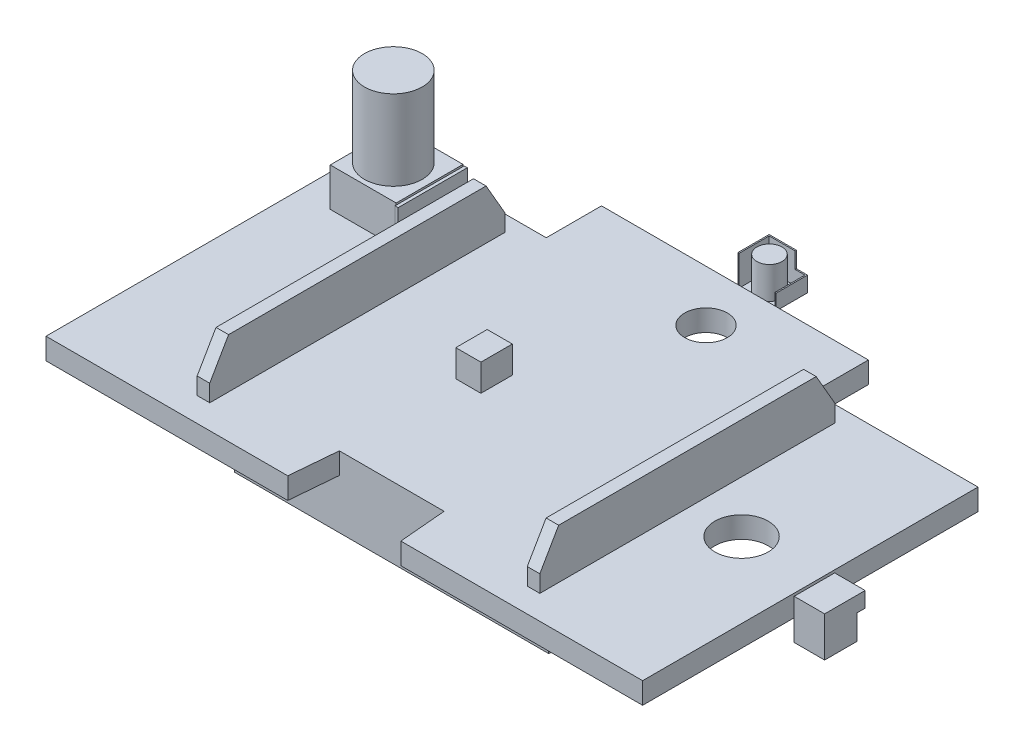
from build123d import *
from OCP.BRepFilletAPI import BRepFilletAPI_MakeChamfer

# Parameters (mm, degrees)
AUFSATZ_LINEAR_AUSTRAGEN1_DEPTH      = 34
SKIZZE3_W                            = 40
SKIZZE3_H                            = 45
AUFSATZ_LINEAR_AUSTRAGEN3_DEPTH      = 31
SKIZZE4_R                            = 42.5
SCHNITT_LINEAR_AUSTRAGEN1_DEPTH      = 597.552596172
AUFSATZ_LINEAR_AUSTRAGEN4_DEPTH      = 48.5
AUFSATZ_LINEAR_AUSTRAGEN4_DEPTH_BACK = 17.5
SKIZZE13_W                           = 69.5
SKIZZE13_H                           = 63.7
SCHNITT_LINEAR_AUSTRAGEN5_DEPTH      = 34
AUFSATZ_LINEAR_START                 = 6.7
SKIZZE18_W                           = 105
SKIZZE18_H                           = 106.5
AUFSATZ_LINEAR_AUSTRAGEN5_DEPTH      = 61.3
SKIZZE19_R                           = 46
AUFSATZ_LINEAR_AUSTRAGEN6_DEPTH      = 127.5
LINEAR_AUSTRAGEN_D_NN1_START         = -53.25
LINEAR_AUSTRAGEN_D_NN1_DEPTH         = 55
SCHNITT_LINEAR_AUSTRAGEN6_DEPTH      = 5.3
SKIZZE22_W                           = 48.5
SKIZZE22_H                           = 24.4
SCHNITT_LINEAR_AUSTRAGEN7_DEPTH      = 5
SKIZZE23_W                           = 40
SKIZZE23_H                           = 50
AUFSATZ_LINEAR_AUSTRAGEN7_DEPTH      = 43
SKIZZE24_R                           = 34
SCHNITT_LINEAR_AUSTRAGEN8_DEPTH      = 663.040406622
SKIZZE25_W                           = 61
SKIZZE25_H                           = 50
AUFSATZ_LINEAR_AUSTRAGEN8_DEPTH      = 50.01
SKIZZE27_W                           = 17.5
SKIZZE27_H                           = 25.5
SCHNITT_LINEAR_AUSTRAGEN10_DEPTH     = 50.01
SKIZZE26_W                           = 57
SKIZZE26_H                           = 48.01
SCHNITT_LINEAR_AUSTRAGEN9_DEPTH      = 48
SKIZZE28_R                           = 20.05
AUFSATZ_LINEAR_AUSTRAGEN9_DEPTH      = 51
SCHNITT_LINEAR_AUSTRAGEN11_DEPTH     = 34
SKIZZE30_W                           = 20
SKIZZE30_H                           = 470
AUFSATZ_LINEAR_AUSTRAGEN10_DEPTH     = 79
SKIZZE31_W                           = 500
SKIZZE31_H                           = 20
SKIZZE31_W_2                         = 580
AUFSATZ_LINEAR_AUSTRAGEN11_DEPTH     = 79
FASE1_SIZE                           = 30
FASE1_SIZE2                          = 51.961524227


with BuildPart() as part:
    # Skizze1 → Aufsatz-Linear austragen1 (new body)
    with BuildSketch(Plane(origin=(0, 0, 0), x_dir=(1, 0, 0), z_dir=(0, 1, 0))):
        Polygon((-212.5, 267), (-212.5, 355), (212.5, 355), (212.5, 267), (475, 267), (475, -267), (-475, -267), (-475, 267), align=None)
    extrude(amount=-AUFSATZ_LINEAR_AUSTRAGEN1_DEPTH)

    # Skizze3 → Aufsatz-Linear austragen3 (add)
    with BuildSketch(Plane.XZ.offset(34)):
        with Locations((0, 74.5)):
            Rectangle(SKIZZE3_W, SKIZZE3_H)
        with Locations((0, -95.5)):
            Rectangle(SKIZZE3_W, SKIZZE3_H)
    extrude(amount=AUFSATZ_LINEAR_AUSTRAGEN3_DEPTH)

    # Skizze4 → Schnitt-Linear austragen1 (cut, through all)
    with BuildSketch(Plane(origin=(0, 0, 0), x_dir=(1, 0, 0), z_dir=(0, 1, 0))):
        with Locations(Location((355, 10.5, 0), (0, 0, 270))):
            Circle(SKIZZE4_R)
    extrude(amount=-SCHNITT_LINEAR_AUSTRAGEN1_DEPTH, mode=Mode.SUBTRACT)

    # Skizze13 → Aufsatz-Linear austragen4 (add, two sides: drawn at the far end of the back side and taken through both)
    with BuildSketch(Plane(origin=(475, 0, 0), x_dir=(0, 0, -1), z_dir=(1, 0, 0)).offset(-AUFSATZ_LINEAR_AUSTRAGEN4_DEPTH_BACK)):
        with Locations((9.05, -36.15)):
            Rectangle(SKIZZE13_W, SKIZZE13_H)
    extrude(amount=AUFSATZ_LINEAR_AUSTRAGEN4_DEPTH + AUFSATZ_LINEAR_AUSTRAGEN4_DEPTH_BACK)

    # Skizze17 → Schnitt-Linear austragen5 (cut)
    with BuildSketch(Plane.XZ.offset(68)):
        with BuildLine():
            Line((523.5, -25.8), (515.060351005, -25.8))
            ThreePointArc((515.060351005, -25.8), (467.505550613, -31.296229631), (475, 15.984853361))
            Line((475, 15.984853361), (475, 25.7))
            Line((475, 25.7), (457.5, 25.7))
            Line((457.5, 25.7), (457.5, -43.8))
            Line((457.5, -43.8), (523.5, -43.8))
            Line((523.5, -43.8), (523.5, -25.8))
        make_face()
    extrude(amount=-SCHNITT_LINEAR_AUSTRAGEN5_DEPTH, mode=Mode.SUBTRACT)



with BuildPart() as body_2:
    # Skizze18 → Aufsatz-Linear austragen5 (new body)
    with BuildSketch(Plane(origin=(0, 0, 0), x_dir=(1, 0, 0), z_dir=(0, 1, 0)).offset(AUFSATZ_LINEAR_START)):
        with Locations((-364.4, 180.73)):
            Rectangle(SKIZZE18_W, SKIZZE18_H)
    extrude(amount=AUFSATZ_LINEAR_AUSTRAGEN5_DEPTH)

    # Skizze19 → Aufsatz-Linear austragen6 (add)
    with BuildSketch(Plane(origin=(0, 68, 0), x_dir=(1, 0, 0), z_dir=(0, 1, 0))):
        with Locations(Location((-369.7, 180.73, 0), (0, 0, 270))):
            Circle(SKIZZE19_R)
    extrude(amount=AUFSATZ_LINEAR_AUSTRAGEN6_DEPTH)


with BuildPart() as part_1:
    add(part.part)

    add(body_2.part)  # Linear-Austragen-D_nn1 merges body 2
    # Skizze20 → Linear-Austragen-D_nn1 (add, symmetric)
    with BuildSketch(Plane.XY.offset(-127.48).offset(LINEAR_AUSTRAGEN_D_NN1_START)):
        Polygon((-311.9, 65), (-311.9, 0), (-277.5, 0), (-277.5, 5), (-306.9, 5), (-306.9, 65), align=None)
    extrude(amount=LINEAR_AUSTRAGEN_D_NN1_DEPTH, both=True)

    # Skizze21 → Schnitt-Linear austragen6 (cut)
    with BuildSketch(Plane.XZ.offset(34)):
        with BuildLine():
            Line((475, -43.8), (523.5, -43.8))
            Line((523.5, -43.8), (523.5, -25.8))
            Line((523.5, -25.8), (515.060351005, -25.8))
            ThreePointArc((515.060351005, -25.8), (497.277916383, -39.443072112), (475, -36.984853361))
            Line((475, -36.984853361), (475, -43.8))
        make_face()
    extrude(amount=-SCHNITT_LINEAR_AUSTRAGEN6_DEPTH, mode=Mode.SUBTRACT)

    # Skizze22 → Schnitt-Linear austragen7 (cut)
    with BuildSketch(Plane(origin=(0, 0, -43.8), x_dir=(-1, 0, 0), z_dir=(0, 0, -1))):
        with Locations((-499.25, -16.5)):
            Rectangle(SKIZZE22_W, SKIZZE22_H)
    extrude(amount=-SCHNITT_LINEAR_AUSTRAGEN7_DEPTH, mode=Mode.SUBTRACT)

    # Skizze23 → Aufsatz-Linear austragen7 (add)
    with BuildSketch(Plane(origin=(0, 0, 0), x_dir=(-1, 0, 0), z_dir=(0, 1, 0))):
        with Locations((70, -25.5)):
            Rectangle(SKIZZE23_W, SKIZZE23_H)
    extrude(amount=AUFSATZ_LINEAR_AUSTRAGEN7_DEPTH)

    # Skizze24 → Schnitt-Linear austragen8 (cut, through all)
    with BuildSketch(Plane(origin=(0, 0, 0), x_dir=(1, 0, 0), z_dir=(0, 1, 0))):
        with Locations(Location((35.42, 273.5, 0), (0, 0, 270))):
            Circle(SKIZZE24_R)
    extrude(amount=-SCHNITT_LINEAR_AUSTRAGEN8_DEPTH, mode=Mode.SUBTRACT)

    # Skizze25 → Aufsatz-Linear austragen8 (add)
    with BuildSketch(Plane(origin=(0, 0, -355), x_dir=(-1, 0, 0), z_dir=(0, 0, -1))):
        with Locations((-34.96, 19)):
            Rectangle(SKIZZE25_W, SKIZZE25_H)
    extrude(amount=AUFSATZ_LINEAR_AUSTRAGEN8_DEPTH)

    # Skizze27 → Schnitt-Linear austragen10 (cut)
    with BuildSketch(Plane(origin=(0, 0, -405.01), x_dir=(-1, 0, 0), z_dir=(0, 0, -1))):
        with Locations((-56.71, 31.25)):
            Rectangle(SKIZZE27_W, SKIZZE27_H)
    extrude(amount=-SCHNITT_LINEAR_AUSTRAGEN10_DEPTH, mode=Mode.SUBTRACT)

    # Skizze26 → Schnitt-Linear austragen9 (cut)
    with BuildSketch(Plane(origin=(0, 44, 0), x_dir=(1, 0, 0), z_dir=(0, 1, 0))):
        with Locations((34.96, 379.005)):
            Rectangle(SKIZZE26_W, SKIZZE26_H)
    extrude(amount=-SCHNITT_LINEAR_AUSTRAGEN9_DEPTH, mode=Mode.SUBTRACT)

    # Skizze28 → Aufsatz-Linear austragen9 (add)
    with BuildSketch(Plane(origin=(0, -4, 0), x_dir=(1, 0, 0), z_dir=(0, 1, 0))):
        with Locations(Location((34.96, 374.995, 0), (0, 0, 265.755162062))):
            Circle(SKIZZE28_R)
    extrude(amount=AUFSATZ_LINEAR_AUSTRAGEN9_DEPTH)

    # Skizze29 → Schnitt-Linear austragen11 (cut)
    with BuildSketch(Plane(origin=(0, 0, 0), x_dir=(1, 0, 0), z_dir=(0, 1, 0))):
        Polygon((-90, -267), (90, -267), (83.394605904, -191.5), (-83.394605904, -191.5), align=None)
    extrude(amount=-SCHNITT_LINEAR_AUSTRAGEN11_DEPTH, mode=Mode.SUBTRACT)

    # Skizze30 → Aufsatz-Linear austragen10 (add)
    with BuildSketch(Plane(origin=(0, 0, 0), x_dir=(1, 0, 0), z_dir=(0, 1, 0))):
        with Locations((-262.8, 6.5)):
            Rectangle(SKIZZE30_W, SKIZZE30_H)
        with Locations((262.8, 6.5)):
            Rectangle(SKIZZE30_W, SKIZZE30_H)
    extrude(amount=AUFSATZ_LINEAR_AUSTRAGEN10_DEPTH)

    # Skizze31 → Aufsatz-Linear austragen11 (add)
    with BuildSketch(Plane.XZ.offset(34)):
        with Locations((0, 181.5)):
            Rectangle(SKIZZE31_W, SKIZZE31_H)
        with Locations((0, -194.5)):
            Rectangle(SKIZZE31_W_2, SKIZZE31_H)
    extrude(amount=AUFSATZ_LINEAR_AUSTRAGEN11_DEPTH)

    # Fase1: one chamfer whose edges measure the first distance from different faces: ONE call of the kernel's chamfer builder (chamfer() names one face for all edges)
    fase1_edges_1 = [part_1.edges().sort_by_distance(p)[0] for p in [
        (-262.8, 79, 228.5),
        (-262.8, 79, -241.5),
    ]]
    fase1_side_1 = [part_1.faces().sort_by_distance(p)[0] for p in [
        (-262.8, 79, -6.5),
    ]]
    fase1_edges_2 = [part_1.edges().sort_by_distance(p)[0] for p in [
        (262.8, 79, 228.5),
        (262.8, 79, -241.5),
    ]]
    fase1_side_2 = [part_1.faces().sort_by_distance(p)[0] for p in [
        (262.8, 79, -6.5),
    ]]
    fase1_edges_3 = [part_1.edges().sort_by_distance(p)[0] for p in [
        (-290, -113, -194.5),
        (290, -113, -194.5),
    ]]
    fase1_side_3 = [part_1.faces().sort_by_distance(p)[0] for p in [
        (0, -113, -194.5),
    ]]
    fase1 = BRepFilletAPI_MakeChamfer(part_1.part.solid().wrapped)
    for e in fase1_edges_1:
        fase1.Add(FASE1_SIZE, FASE1_SIZE2, e.wrapped, fase1_side_1[0].wrapped)  # the first distance lies on this face
    for e in fase1_edges_2:
        fase1.Add(FASE1_SIZE, FASE1_SIZE2, e.wrapped, fase1_side_2[0].wrapped)  # the first distance lies on this face
    for e in fase1_edges_3:
        fase1.Add(FASE1_SIZE, FASE1_SIZE2, e.wrapped, fase1_side_3[0].wrapped)  # the first distance lies on this face
    add(Compound.cast(fase1.Shape()), mode=Mode.REPLACE)


solid = part_1.part
